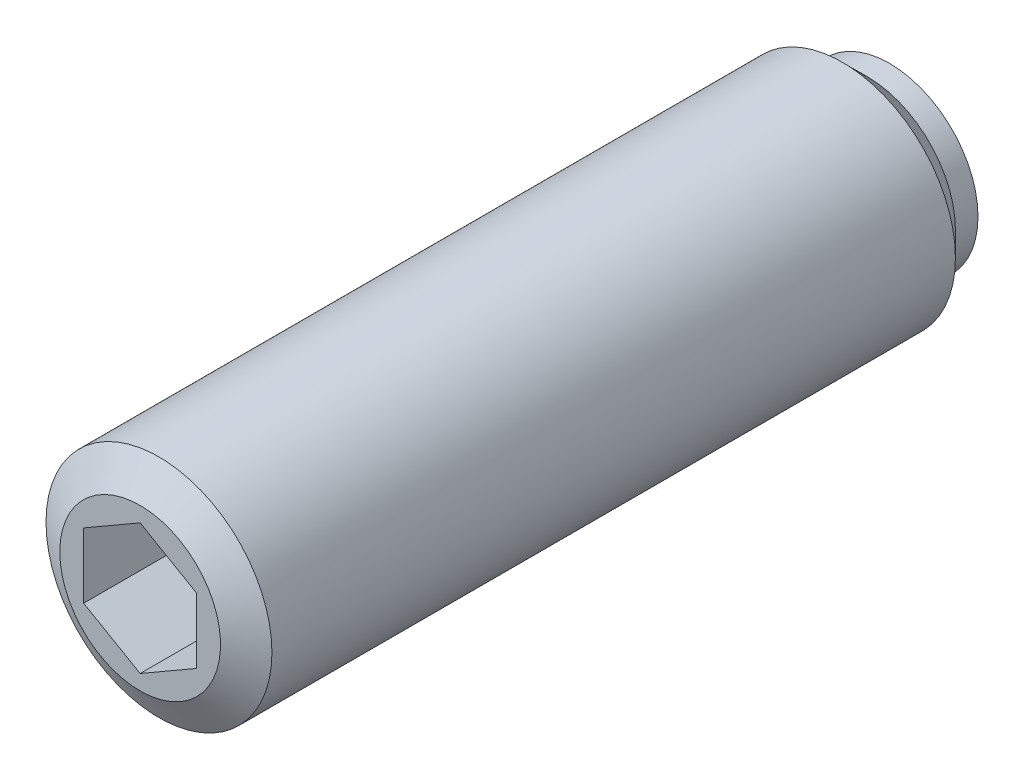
ISO-10303-21;
HEADER;
FILE_DESCRIPTION(('STEP AP214'),'2;1');
FILE_NAME('part.step','',(''),(''),'','','');
FILE_SCHEMA(('AUTOMOTIVE_DESIGN { 1 0 10303 214 1 1 1 1 }'));
ENDSEC;
DATA;
#1=APPLICATION_CONTEXT('core data for automotive mechanical design processes');
#2=APPLICATION_PROTOCOL_DEFINITION('international standard','automotive_design',2000,#1);
#3=PRODUCT_CONTEXT('',#1,'mechanical');
#4=PRODUCT('Part','Part','',(#3));
#5=PRODUCT_RELATED_PRODUCT_CATEGORY('part','',(#4));
#6=PRODUCT_DEFINITION_FORMATION('','',#4);
#7=PRODUCT_DEFINITION_CONTEXT('part definition',#1,'design');
#8=PRODUCT_DEFINITION('design','',#6,#7);
#9=PRODUCT_DEFINITION_SHAPE('','',#8);
#10=(LENGTH_UNIT() NAMED_UNIT(*) SI_UNIT(.MILLI.,.METRE.));
#11=(NAMED_UNIT(*) PLANE_ANGLE_UNIT() SI_UNIT($,.RADIAN.));
#12=(NAMED_UNIT(*) SI_UNIT($,.STERADIAN.) SOLID_ANGLE_UNIT());
#13=UNCERTAINTY_MEASURE_WITH_UNIT(LENGTH_MEASURE(1.E-05),#10,'distance_accuracy_value','');
#14=(GEOMETRIC_REPRESENTATION_CONTEXT(3) GLOBAL_UNCERTAINTY_ASSIGNED_CONTEXT((#13)) GLOBAL_UNIT_ASSIGNED_CONTEXT((#10,
#11,#12)) REPRESENTATION_CONTEXT('',''));
#15=CARTESIAN_POINT('',(0.,0.,0.));
#16=DIRECTION('',(0.,0.,1.));
#17=DIRECTION('',(1.,0.,0.));
#18=AXIS2_PLACEMENT_3D('',#15,#16,#17);
#19=CARTESIAN_POINT('',(0.,1.50253119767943,0.));
#20=DIRECTION('',(0.,0.,1.));
#21=DIRECTION('',(-1.,0.,0.));
#22=AXIS2_PLACEMENT_3D('',#19,#20,#21);
#23=PLANE('',#22);
#24=CARTESIAN_POINT('',(0.,0.,0.));
#25=DIRECTION('',(0.,0.,1.));
#26=DIRECTION('',(-1.,0.,0.));
#27=AXIS2_PLACEMENT_3D('',#24,#25,#26);
#28=CIRCLE('',#27,1.50253119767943);
#29=CARTESIAN_POINT('',(0.,1.50253119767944,0.));
#30=VERTEX_POINT('',#29);
#31=EDGE_CURVE('E9',#30,#30,#28,.T.);
#32=ORIENTED_EDGE('',*,*,#31,.F.);
#33=EDGE_LOOP('',(#32));
#34=FACE_BOUND('',#33,.T.);
#35=ADVANCED_FACE('F14',(#34),#23,.F.);
#36=CARTESIAN_POINT('',(0.,0.,1.32));
#37=DIRECTION('',(0.,0.,1.));
#38=DIRECTION('',(0.,1.,0.));
#39=AXIS2_PLACEMENT_3D('',#36,#37,#38);
#40=SPHERICAL_SURFACE('',#39,2.);
#41=CARTESIAN_POINT('',(0.,0.,0.4));
#42=DIRECTION('',(0.,0.,1.));
#43=DIRECTION('',(-1.,0.,0.));
#44=AXIS2_PLACEMENT_3D('',#41,#42,#43);
#45=CIRCLE('',#44,1.77583783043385);
#46=CARTESIAN_POINT('',(0.,1.77583783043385,0.4));
#47=VERTEX_POINT('',#46);
#48=EDGE_CURVE('E21',#47,#47,#45,.T.);
#49=CARTESIAN_POINT('',(0.,1.77583783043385,0.4));
#50=CARTESIAN_POINT('',(0.,1.77351077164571,0.395508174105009));
#51=CARTESIAN_POINT('',(0.,1.77116666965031,0.391025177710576));
#52=CARTESIAN_POINT('',(0.,1.76644451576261,0.382077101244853));
#53=CARTESIAN_POINT('',(0.,1.76406646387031,0.377612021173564));
#54=CARTESIAN_POINT('',(0.,1.75927654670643,0.368700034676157));
#55=CARTESIAN_POINT('',(0.,1.75686468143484,0.36425312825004));
#56=CARTESIAN_POINT('',(0.,1.75200727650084,0.355377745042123));
#57=CARTESIAN_POINT('',(0.,1.74956173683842,0.350949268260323));
#58=CARTESIAN_POINT('',(0.,1.74463712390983,0.342110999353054));
#59=CARTESIAN_POINT('',(0.,1.74215805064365,0.337701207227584));
#60=CARTESIAN_POINT('',(0.,1.73716651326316,0.328900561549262));
#61=CARTESIAN_POINT('',(0.,1.73465404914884,0.324509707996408));
#62=CARTESIAN_POINT('',(0.,1.72959587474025,0.315747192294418));
#63=CARTESIAN_POINT('',(0.,1.72705016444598,0.311375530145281));
#64=CARTESIAN_POINT('',(0.,1.72192564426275,0.302651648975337));
#65=CARTESIAN_POINT('',(0.,1.71934683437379,0.29829942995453));
#66=CARTESIAN_POINT('',(0.,1.71415626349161,0.289614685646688));
#67=CARTESIAN_POINT('',(0.,1.71154450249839,0.285282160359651));
#68=CARTESIAN_POINT('',(0.,1.7062881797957,0.276637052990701));
#69=CARTESIAN_POINT('',(0.,1.70364361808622,0.272324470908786));
#70=CARTESIAN_POINT('',(0.,1.69832184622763,0.263719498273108));
#71=CARTESIAN_POINT('',(0.,1.69564463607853,0.259427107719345));
#72=CARTESIAN_POINT('',(0.,1.69025772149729,0.250862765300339));
#73=CARTESIAN_POINT('',(0.,1.68754801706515,0.246590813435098));
#74=CARTESIAN_POINT('',(0.,1.68209626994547,0.238067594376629));
#75=CARTESIAN_POINT('',(0.,1.67935422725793,0.233816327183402));
#76=CARTESIAN_POINT('',(0.,1.67383796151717,0.225334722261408));
#77=CARTESIAN_POINT('',(0.,1.67106373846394,0.221104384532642));
#78=CARTESIAN_POINT('',(0.,1.66548327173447,0.212664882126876));
#79=CARTESIAN_POINT('',(0.,1.66267702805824,0.208455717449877));
#80=CARTESIAN_POINT('',(0.,1.65703268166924,0.200058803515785));
#81=CARTESIAN_POINT('',(0.,1.65419457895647,0.195871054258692));
#82=CARTESIAN_POINT('',(0.,1.64848667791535,0.18751721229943));
#83=CARTESIAN_POINT('',(0.,1.645616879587,0.18335111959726));
#84=CARTESIAN_POINT('',(0.,1.63984575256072,0.175040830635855));
#85=CARTESIAN_POINT('',(0.,1.63694442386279,0.170896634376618));
#86=CARTESIAN_POINT('',(0.,1.63111040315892,0.162630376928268));
#87=CARTESIAN_POINT('',(0.,1.62817771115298,0.158508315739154));
#88=CARTESIAN_POINT('',(0.,1.62228113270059,0.150286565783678));
#89=CARTESIAN_POINT('',(0.,1.61931724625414,0.146186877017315));
#90=CARTESIAN_POINT('',(0.,1.61335844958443,0.138010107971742));
#91=CARTESIAN_POINT('',(0.,1.61036353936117,0.133933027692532));
#92=CARTESIAN_POINT('',(0.,1.60434286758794,0.125801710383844));
#93=CARTESIAN_POINT('',(0.,1.60131710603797,0.121747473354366));
#94=CARTESIAN_POINT('',(0.,1.59523490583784,0.113662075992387));
#95=CARTESIAN_POINT('',(0.,1.59217846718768,0.109630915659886));
#96=CARTESIAN_POINT('',(0.,1.58603508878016,0.101591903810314));
#97=CARTESIAN_POINT('',(0.,1.58294814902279,0.0975840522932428));
#98=CARTESIAN_POINT('',(0.,1.57674394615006,0.0895918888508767));
#99=CARTESIAN_POINT('',(0.,1.57362668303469,0.0856075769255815));
#100=CARTESIAN_POINT('',(0.,1.56736201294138,0.0776627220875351));
#101=CARTESIAN_POINT('',(0.,1.56421460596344,0.0737021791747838));
#102=CARTESIAN_POINT('',(0.,1.55788982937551,0.0658050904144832));
#103=CARTESIAN_POINT('',(0.,1.55471245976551,0.0618685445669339));
#104=CARTESIAN_POINT('',(0.,1.54832794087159,0.0540196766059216));
#105=CARTESIAN_POINT('',(0.,1.54512079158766,0.0501073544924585));
#106=CARTESIAN_POINT('',(0.,1.53867689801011,0.0423071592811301));
#107=CARTESIAN_POINT('',(0.,1.53544015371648,0.0384192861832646));
#108=CARTESIAN_POINT('',(0.,1.52893725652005,0.0306682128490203));
#109=CARTESIAN_POINT('',(0.,1.52567110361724,0.0268050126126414));
#110=CARTESIAN_POINT('',(0.,1.5191095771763,0.019103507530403));
#111=CARTESIAN_POINT('',(0.,1.51581420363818,0.0152652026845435));
#112=CARTESIAN_POINT('',(0.,1.50919442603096,0.00761370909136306));
#113=CARTESIAN_POINT('',(0.,1.50587002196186,0.00380052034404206));
#114=CARTESIAN_POINT('',(0.,1.50253119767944,0.));
#115=B_SPLINE_CURVE_WITH_KNOTS('',3,(#49,#50,#51,#52,#53,#54,#55,#56,#57,#58,#59,#60,#61,#62,
#63,#64,#65,#66,#67,#68,#69,#70,#71,#72,#73,#74,#75,#76,#77,#78,#79,#80,#81,#82,#83,#84,#85,#86,
#87,#88,#89,#90,#91,#92,#93,#94,#95,#96,#97,#98,#99,#100,#101,#102,#103,#104,#105,#106,#107,
#108,#109,#110,#111,#112,#113,#114),.UNSPECIFIED.,.F.,.F.,(4,2,2,2,2,2,2,2,2,2,2,2,2,2,2,2,2,2,
2,2,2,2,2,2,2,2,2,2,2,2,2,2,4),(0.,0.0151764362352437,0.0303528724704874,0.0455293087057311,
0.0607057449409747,0.0758821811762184,0.0910586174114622,0.106235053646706,0.121411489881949,
0.136587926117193,0.151764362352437,0.16694079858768,0.182117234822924,0.197293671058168,
0.212470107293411,0.227646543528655,0.242822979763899,0.257999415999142,0.273175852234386,
0.28835228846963,0.303528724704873,0.318705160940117,0.33388159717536,0.349058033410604,
0.364234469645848,0.379410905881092,0.394587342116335,0.409763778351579,0.424940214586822,
0.440116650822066,0.45529308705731,0.470469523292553,0.485645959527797),.UNSPECIFIED.);
#116=EDGE_CURVE('BSEAM141',#47,#30,#115,.T.);
#117=ORIENTED_EDGE('',*,*,#48,.F.);
#118=ORIENTED_EDGE('',*,*,#31,.T.);
#119=ORIENTED_EDGE('',*,*,#116,.T.);
#120=ORIENTED_EDGE('',*,*,#116,.F.);
#121=EDGE_LOOP('',(#117,#119,#118,#120));
#122=FACE_BOUND('',#121,.T.);
#123=ADVANCED_FACE('F141',(#122),#40,.T.);
#124=CARTESIAN_POINT('',(0.,2.35,0.4));
#125=DIRECTION('',(0.,0.,1.));
#126=DIRECTION('',(-1.,0.,0.));
#127=AXIS2_PLACEMENT_3D('',#124,#125,#126);
#128=PLANE('',#127);
#129=CARTESIAN_POINT('',(0.,0.,0.4));
#130=DIRECTION('',(0.,0.,1.));
#131=DIRECTION('',(-1.,0.,0.));
#132=AXIS2_PLACEMENT_3D('',#129,#130,#131);
#133=CIRCLE('',#132,2.35);
#134=CARTESIAN_POINT('',(-2.35,0.,0.4));
#135=VERTEX_POINT('',#134);
#136=EDGE_CURVE('E134',#135,#135,#133,.T.);
#137=ORIENTED_EDGE('',*,*,#136,.F.);
#138=EDGE_LOOP('',(#137));
#139=FACE_BOUND('',#138,.T.);
#140=ORIENTED_EDGE('',*,*,#48,.T.);
#141=EDGE_LOOP('',(#140));
#142=FACE_BOUND('',#141,.T.);
#143=ADVANCED_FACE('F139',(#139,#142),#128,.F.);
#144=CARTESIAN_POINT('',(0.,0.,21.6950749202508));
#145=DIRECTION('',(0.,0.,1.));
#146=DIRECTION('',(-1.,0.,0.));
#147=AXIS2_PLACEMENT_3D('',#144,#145,#146);
#148=CYLINDRICAL_SURFACE('',#147,2.35);
#149=CARTESIAN_POINT('',(0.,0.,1.));
#150=DIRECTION('',(0.,0.,1.));
#151=DIRECTION('',(-1.,0.,0.));
#152=AXIS2_PLACEMENT_3D('',#149,#150,#151);
#153=CIRCLE('',#152,2.35);
#154=CARTESIAN_POINT('',(-2.35,0.,1.));
#155=VERTEX_POINT('',#154);
#156=EDGE_CURVE('E131',#155,#155,#153,.T.);
#157=ORIENTED_EDGE('',*,*,#156,.F.);
#158=EDGE_LOOP('',(#157));
#159=FACE_BOUND('',#158,.T.);
#160=ORIENTED_EDGE('',*,*,#136,.T.);
#161=EDGE_LOOP('',(#160));
#162=FACE_BOUND('',#161,.T.);
#163=ADVANCED_FACE('F164',(#159,#162),#148,.T.);
#164=CARTESIAN_POINT('',(0.,0.,1.));
#165=DIRECTION('',(0.,0.,1.));
#166=DIRECTION('',(-1.,0.,0.));
#167=AXIS2_PLACEMENT_3D('',#164,#165,#166);
#168=CONICAL_SURFACE('',#167,2.35,0.785398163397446);
#169=CARTESIAN_POINT('',(0.,0.,1.65));
#170=DIRECTION('',(0.,0.,1.));
#171=DIRECTION('',(-1.,0.,0.));
#172=AXIS2_PLACEMENT_3D('',#169,#170,#171);
#173=CIRCLE('',#172,3.);
#174=CARTESIAN_POINT('',(-3.,0.,1.65));
#175=VERTEX_POINT('',#174);
#176=EDGE_CURVE('E128',#175,#175,#173,.T.);
#177=ORIENTED_EDGE('',*,*,#176,.F.);
#178=EDGE_LOOP('',(#177));
#179=FACE_BOUND('',#178,.T.);
#180=ORIENTED_EDGE('',*,*,#156,.T.);
#181=EDGE_LOOP('',(#180));
#182=FACE_BOUND('',#181,.T.);
#183=ADVANCED_FACE('F173',(#179,#182),#168,.T.);
#184=CARTESIAN_POINT('',(0.,0.,21.6950749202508));
#185=DIRECTION('',(0.,0.,1.));
#186=DIRECTION('',(-1.,0.,0.));
#187=AXIS2_PLACEMENT_3D('',#184,#185,#186);
#188=CYLINDRICAL_SURFACE('',#187,3.);
#189=CARTESIAN_POINT('',(0.,0.,19.8));
#190=DIRECTION('',(0.,0.,1.));
#191=DIRECTION('',(-1.,0.,0.));
#192=AXIS2_PLACEMENT_3D('',#189,#190,#191);
#193=CIRCLE('',#192,3.);
#194=CARTESIAN_POINT('',(-3.,0.,19.8));
#195=VERTEX_POINT('',#194);
#196=EDGE_CURVE('E125',#195,#195,#193,.T.);
#197=ORIENTED_EDGE('',*,*,#196,.F.);
#198=EDGE_LOOP('',(#197));
#199=FACE_BOUND('',#198,.T.);
#200=ORIENTED_EDGE('',*,*,#176,.T.);
#201=EDGE_LOOP('',(#200));
#202=FACE_BOUND('',#201,.T.);
#203=ADVANCED_FACE('F182',(#199,#202),#188,.T.);
#204=CARTESIAN_POINT('',(0.,0.,19.8));
#205=DIRECTION('',(0.,0.,-1.));
#206=DIRECTION('',(1.,0.,0.));
#207=AXIS2_PLACEMENT_3D('',#204,#205,#206);
#208=CONICAL_SURFACE('',#207,3.,1.04719755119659);
#209=CARTESIAN_POINT('',(0.,0.,20.3));
#210=DIRECTION('',(0.,0.,1.));
#211=DIRECTION('',(-1.,0.,0.));
#212=AXIS2_PLACEMENT_3D('',#209,#210,#211);
#213=CIRCLE('',#212,2.13397459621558);
#214=CARTESIAN_POINT('',(-2.13397459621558,0.,20.3));
#215=VERTEX_POINT('',#214);
#216=EDGE_CURVE('E116',#215,#215,#213,.T.);
#217=ORIENTED_EDGE('',*,*,#216,.F.);
#218=EDGE_LOOP('',(#217));
#219=FACE_BOUND('',#218,.T.);
#220=ORIENTED_EDGE('',*,*,#196,.T.);
#221=EDGE_LOOP('',(#220));
#222=FACE_BOUND('',#221,.T.);
#223=ADVANCED_FACE('F191',(#219,#222),#208,.T.);
#224=CARTESIAN_POINT('',(0.,0.,20.3));
#225=DIRECTION('',(0.,0.,-1.));
#226=DIRECTION('',(1.,0.,0.));
#227=AXIS2_PLACEMENT_3D('',#224,#225,#226);
#228=PLANE('',#227);
#229=DIRECTION('',(-0.866025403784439,-0.5,0.));
#230=VECTOR('',#229,1.);
#231=CARTESIAN_POINT('',(0.,1.73205080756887,20.3));
#232=LINE('',#231,#230);
#233=CARTESIAN_POINT('',(0.,1.73205080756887,20.3));
#234=VERTEX_POINT('',#233);
#235=CARTESIAN_POINT('',(-1.5,0.866025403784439,20.3));
#236=VERTEX_POINT('',#235);
#237=EDGE_CURVE('E82',#234,#236,#232,.T.);
#238=ORIENTED_EDGE('',*,*,#237,.F.);
#239=DIRECTION('',(-0.866025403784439,0.5,0.));
#240=VECTOR('',#239,1.);
#241=CARTESIAN_POINT('',(1.5,0.866025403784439,20.3));
#242=LINE('',#241,#240);
#243=CARTESIAN_POINT('',(1.5,0.866025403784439,20.3));
#244=VERTEX_POINT('',#243);
#245=EDGE_CURVE('E28',#244,#234,#242,.T.);
#246=ORIENTED_EDGE('',*,*,#245,.F.);
#247=DIRECTION('',(0.,1.,0.));
#248=VECTOR('',#247,1.);
#249=CARTESIAN_POINT('',(1.5,-0.866025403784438,20.3));
#250=LINE('',#249,#248);
#251=CARTESIAN_POINT('',(1.5,-0.866025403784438,20.3));
#252=VERTEX_POINT('',#251);
#253=EDGE_CURVE('E98',#252,#244,#250,.T.);
#254=ORIENTED_EDGE('',*,*,#253,.F.);
#255=DIRECTION('',(0.866025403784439,0.5,0.));
#256=VECTOR('',#255,1.);
#257=CARTESIAN_POINT('',(0.,-1.73205080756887,20.3));
#258=LINE('',#257,#256);
#259=CARTESIAN_POINT('',(0.,-1.73205080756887,20.3));
#260=VERTEX_POINT('',#259);
#261=EDGE_CURVE('E92',#260,#252,#258,.T.);
#262=ORIENTED_EDGE('',*,*,#261,.F.);
#263=DIRECTION('',(0.866025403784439,-0.5,0.));
#264=VECTOR('',#263,1.);
#265=CARTESIAN_POINT('',(-1.5,-0.866025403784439,20.3));
#266=LINE('',#265,#264);
#267=CARTESIAN_POINT('',(-1.5,-0.866025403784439,20.3));
#268=VERTEX_POINT('',#267);
#269=EDGE_CURVE('E90',#268,#260,#266,.T.);
#270=ORIENTED_EDGE('',*,*,#269,.F.);
#271=DIRECTION('',(0.,-1.,0.));
#272=VECTOR('',#271,1.);
#273=CARTESIAN_POINT('',(-1.5,0.866025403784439,20.3));
#274=LINE('',#273,#272);
#275=EDGE_CURVE('E71',#236,#268,#274,.T.);
#276=ORIENTED_EDGE('',*,*,#275,.F.);
#277=EDGE_LOOP('',(#238,#246,#254,#262,#270,#276));
#278=FACE_BOUND('',#277,.T.);
#279=ORIENTED_EDGE('',*,*,#216,.T.);
#280=EDGE_LOOP('',(#279));
#281=FACE_BOUND('',#280,.T.);
#282=ADVANCED_FACE('F86',(#278,#281),#228,.F.);
#283=CARTESIAN_POINT('',(1.5,0.866025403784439,17.3));
#284=DIRECTION('',(0.5,0.866025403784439,0.));
#285=DIRECTION('',(0.866025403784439,-0.5,0.));
#286=AXIS2_PLACEMENT_3D('',#283,#284,#285);
#287=PLANE('',#286);
#288=ORIENTED_EDGE('',*,*,#245,.T.);
#289=DIRECTION('',(0.,0.,1.));
#290=VECTOR('',#289,1.);
#291=CARTESIAN_POINT('',(0.,1.73205080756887,17.3));
#292=LINE('',#291,#290);
#293=CARTESIAN_POINT('',(0.,1.73205080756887,17.3));
#294=VERTEX_POINT('',#293);
#295=EDGE_CURVE('E79',#294,#234,#292,.T.);
#296=ORIENTED_EDGE('',*,*,#295,.F.);
#297=DIRECTION('',(-0.866025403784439,0.5,0.));
#298=VECTOR('',#297,1.);
#299=CARTESIAN_POINT('',(1.5,0.866025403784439,17.3));
#300=LINE('',#299,#298);
#301=CARTESIAN_POINT('',(1.5,0.866025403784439,17.3));
#302=VERTEX_POINT('',#301);
#303=EDGE_CURVE('E100',#302,#294,#300,.T.);
#304=ORIENTED_EDGE('',*,*,#303,.F.);
#305=DIRECTION('',(0.,0.,1.));
#306=VECTOR('',#305,1.);
#307=CARTESIAN_POINT('',(1.5,0.866025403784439,17.3));
#308=LINE('',#307,#306);
#309=EDGE_CURVE('E35',#302,#244,#308,.T.);
#310=ORIENTED_EDGE('',*,*,#309,.T.);
#311=EDGE_LOOP('',(#288,#296,#304,#310));
#312=FACE_BOUND('',#311,.T.);
#313=ADVANCED_FACE('F208',(#312),#287,.F.);
#314=CARTESIAN_POINT('',(1.5,-0.866025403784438,17.3));
#315=DIRECTION('',(1.,0.,0.));
#316=DIRECTION('',(0.,-1.,0.));
#317=AXIS2_PLACEMENT_3D('',#314,#315,#316);
#318=PLANE('',#317);
#319=ORIENTED_EDGE('',*,*,#253,.T.);
#320=ORIENTED_EDGE('',*,*,#309,.F.);
#321=DIRECTION('',(0.,1.,0.));
#322=VECTOR('',#321,1.);
#323=CARTESIAN_POINT('',(1.5,-0.866025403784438,17.3));
#324=LINE('',#323,#322);
#325=CARTESIAN_POINT('',(1.5,-0.866025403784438,17.3));
#326=VERTEX_POINT('',#325);
#327=EDGE_CURVE('E112',#326,#302,#324,.T.);
#328=ORIENTED_EDGE('',*,*,#327,.F.);
#329=DIRECTION('',(0.,0.,1.));
#330=VECTOR('',#329,1.);
#331=CARTESIAN_POINT('',(1.5,-0.866025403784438,17.3));
#332=LINE('',#331,#330);
#333=EDGE_CURVE('E117',#326,#252,#332,.T.);
#334=ORIENTED_EDGE('',*,*,#333,.T.);
#335=EDGE_LOOP('',(#319,#320,#328,#334));
#336=FACE_BOUND('',#335,.T.);
#337=ADVANCED_FACE('F216',(#336),#318,.F.);
#338=CARTESIAN_POINT('',(0.,-1.73205080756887,17.3));
#339=DIRECTION('',(0.5,-0.866025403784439,0.));
#340=DIRECTION('',(-0.866025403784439,-0.5,0.));
#341=AXIS2_PLACEMENT_3D('',#338,#339,#340);
#342=PLANE('',#341);
#343=ORIENTED_EDGE('',*,*,#261,.T.);
#344=ORIENTED_EDGE('',*,*,#333,.F.);
#345=DIRECTION('',(0.866025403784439,0.5,0.));
#346=VECTOR('',#345,1.);
#347=CARTESIAN_POINT('',(0.,-1.73205080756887,17.3));
#348=LINE('',#347,#346);
#349=CARTESIAN_POINT('',(0.,-1.73205080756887,17.3));
#350=VERTEX_POINT('',#349);
#351=EDGE_CURVE('E109',#350,#326,#348,.T.);
#352=ORIENTED_EDGE('',*,*,#351,.F.);
#353=DIRECTION('',(0.,0.,1.));
#354=VECTOR('',#353,1.);
#355=CARTESIAN_POINT('',(0.,-1.73205080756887,17.3));
#356=LINE('',#355,#354);
#357=EDGE_CURVE('E119',#350,#260,#356,.T.);
#358=ORIENTED_EDGE('',*,*,#357,.T.);
#359=EDGE_LOOP('',(#343,#344,#352,#358));
#360=FACE_BOUND('',#359,.T.);
#361=ADVANCED_FACE('F224',(#360),#342,.F.);
#362=CARTESIAN_POINT('',(-1.5,-0.866025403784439,17.3));
#363=DIRECTION('',(-0.5,-0.866025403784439,0.));
#364=DIRECTION('',(-0.866025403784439,0.5,0.));
#365=AXIS2_PLACEMENT_3D('',#362,#363,#364);
#366=PLANE('',#365);
#367=ORIENTED_EDGE('',*,*,#269,.T.);
#368=ORIENTED_EDGE('',*,*,#357,.F.);
#369=DIRECTION('',(0.866025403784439,-0.5,0.));
#370=VECTOR('',#369,1.);
#371=CARTESIAN_POINT('',(-1.5,-0.866025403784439,17.3));
#372=LINE('',#371,#370);
#373=CARTESIAN_POINT('',(-1.5,-0.866025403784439,17.3));
#374=VERTEX_POINT('',#373);
#375=EDGE_CURVE('E106',#374,#350,#372,.T.);
#376=ORIENTED_EDGE('',*,*,#375,.F.);
#377=DIRECTION('',(0.,0.,1.));
#378=VECTOR('',#377,1.);
#379=CARTESIAN_POINT('',(-1.5,-0.866025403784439,17.3));
#380=LINE('',#379,#378);
#381=EDGE_CURVE('E78',#374,#268,#380,.T.);
#382=ORIENTED_EDGE('',*,*,#381,.T.);
#383=EDGE_LOOP('',(#367,#368,#376,#382));
#384=FACE_BOUND('',#383,.T.);
#385=ADVANCED_FACE('F232',(#384),#366,.F.);
#386=CARTESIAN_POINT('',(-1.5,0.866025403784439,17.3));
#387=DIRECTION('',(-1.,0.,0.));
#388=DIRECTION('',(0.,1.,0.));
#389=AXIS2_PLACEMENT_3D('',#386,#387,#388);
#390=PLANE('',#389);
#391=ORIENTED_EDGE('',*,*,#275,.T.);
#392=ORIENTED_EDGE('',*,*,#381,.F.);
#393=DIRECTION('',(0.,-1.,0.));
#394=VECTOR('',#393,1.);
#395=CARTESIAN_POINT('',(-1.5,0.866025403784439,17.3));
#396=LINE('',#395,#394);
#397=CARTESIAN_POINT('',(-1.5,0.866025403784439,17.3));
#398=VERTEX_POINT('',#397);
#399=EDGE_CURVE('E74',#398,#374,#396,.T.);
#400=ORIENTED_EDGE('',*,*,#399,.F.);
#401=DIRECTION('',(0.,0.,1.));
#402=VECTOR('',#401,1.);
#403=CARTESIAN_POINT('',(-1.5,0.866025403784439,17.3));
#404=LINE('',#403,#402);
#405=EDGE_CURVE('E67',#398,#236,#404,.T.);
#406=ORIENTED_EDGE('',*,*,#405,.T.);
#407=EDGE_LOOP('',(#391,#392,#400,#406));
#408=FACE_BOUND('',#407,.T.);
#409=ADVANCED_FACE('F69',(#408),#390,.F.);
#410=CARTESIAN_POINT('',(0.,1.73205080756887,17.3));
#411=DIRECTION('',(-0.5,0.866025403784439,0.));
#412=DIRECTION('',(0.866025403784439,0.5,0.));
#413=AXIS2_PLACEMENT_3D('',#410,#411,#412);
#414=PLANE('',#413);
#415=ORIENTED_EDGE('',*,*,#237,.T.);
#416=ORIENTED_EDGE('',*,*,#405,.F.);
#417=DIRECTION('',(-0.866025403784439,-0.5,0.));
#418=VECTOR('',#417,1.);
#419=CARTESIAN_POINT('',(0.,1.73205080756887,17.3));
#420=LINE('',#419,#418);
#421=EDGE_CURVE('E103',#294,#398,#420,.T.);
#422=ORIENTED_EDGE('',*,*,#421,.F.);
#423=ORIENTED_EDGE('',*,*,#295,.T.);
#424=EDGE_LOOP('',(#415,#416,#422,#423));
#425=FACE_BOUND('',#424,.T.);
#426=ADVANCED_FACE('F83',(#425),#414,.F.);
#427=CARTESIAN_POINT('',(3.,0.,17.3));
#428=DIRECTION('',(0.,0.,-1.));
#429=DIRECTION('',(1.,0.,0.));
#430=AXIS2_PLACEMENT_3D('',#427,#428,#429);
#431=PLANE('',#430);
#432=ORIENTED_EDGE('',*,*,#303,.T.);
#433=ORIENTED_EDGE('',*,*,#421,.T.);
#434=ORIENTED_EDGE('',*,*,#399,.T.);
#435=ORIENTED_EDGE('',*,*,#375,.T.);
#436=ORIENTED_EDGE('',*,*,#351,.T.);
#437=ORIENTED_EDGE('',*,*,#327,.T.);
#438=EDGE_LOOP('',(#432,#433,#434,#435,#436,#437));
#439=FACE_BOUND('',#438,.T.);
#440=ADVANCED_FACE('F256',(#439),#431,.F.);
#441=CLOSED_SHELL('',(#35,#123,#143,#163,#183,#203,#223,#282,#313,#337,#361,#385,#409,#426,#440));
#442=MANIFOLD_SOLID_BREP('B1',#441);
#443=ADVANCED_BREP_SHAPE_REPRESENTATION('',(#18,#442),#14);
#444=SHAPE_DEFINITION_REPRESENTATION(#9,#443);
ENDSEC;
END-ISO-10303-21;
